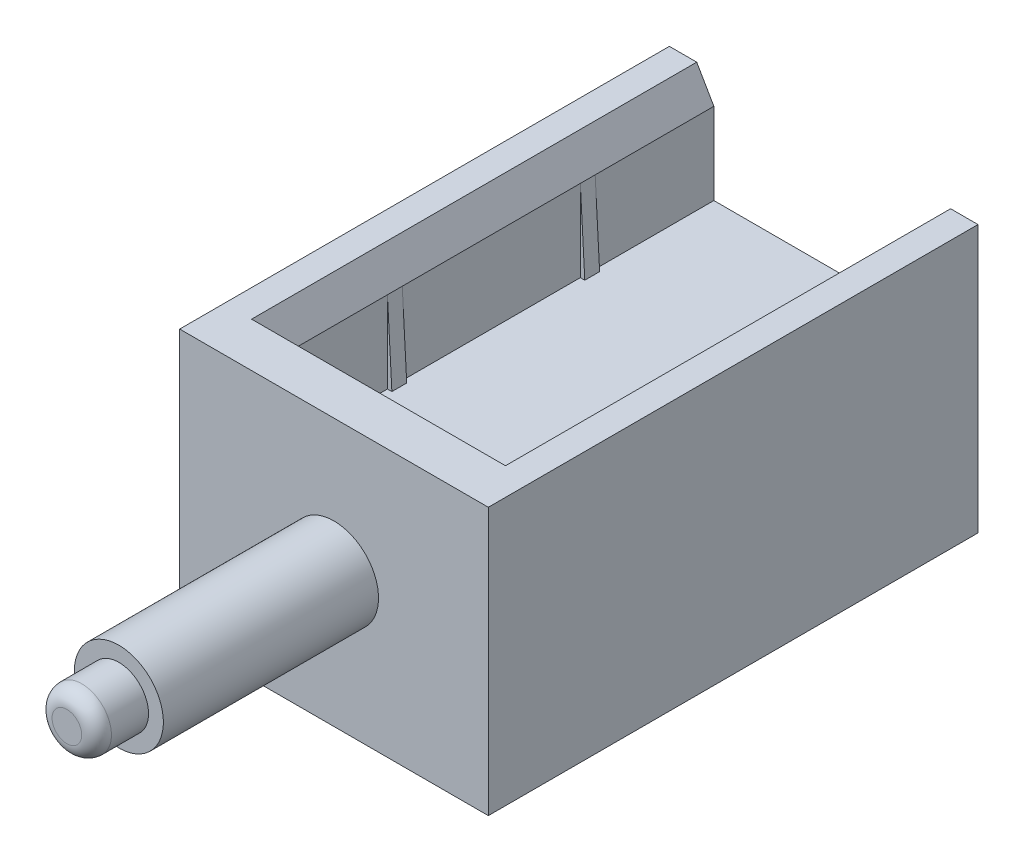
ISO-10303-21;
HEADER;
FILE_DESCRIPTION(('STEP AP214'),'2;1');
FILE_NAME('part.step','',(''),(''),'','','');
FILE_SCHEMA(('AUTOMOTIVE_DESIGN { 1 0 10303 214 1 1 1 1 }'));
ENDSEC;
DATA;
#1=APPLICATION_CONTEXT('core data for automotive mechanical design processes');
#2=APPLICATION_PROTOCOL_DEFINITION('international standard','automotive_design',2000,#1);
#3=PRODUCT_CONTEXT('',#1,'mechanical');
#4=PRODUCT('Part','Part','',(#3));
#5=PRODUCT_RELATED_PRODUCT_CATEGORY('part','',(#4));
#6=PRODUCT_DEFINITION_FORMATION('','',#4);
#7=PRODUCT_DEFINITION_CONTEXT('part definition',#1,'design');
#8=PRODUCT_DEFINITION('design','',#6,#7);
#9=PRODUCT_DEFINITION_SHAPE('','',#8);
#10=(LENGTH_UNIT() NAMED_UNIT(*) SI_UNIT(.MILLI.,.METRE.));
#11=(NAMED_UNIT(*) PLANE_ANGLE_UNIT() SI_UNIT($,.RADIAN.));
#12=(NAMED_UNIT(*) SI_UNIT($,.STERADIAN.) SOLID_ANGLE_UNIT());
#13=UNCERTAINTY_MEASURE_WITH_UNIT(LENGTH_MEASURE(1.E-05),#10,'distance_accuracy_value','');
#14=(GEOMETRIC_REPRESENTATION_CONTEXT(3) GLOBAL_UNCERTAINTY_ASSIGNED_CONTEXT((#13)) GLOBAL_UNIT_ASSIGNED_CONTEXT((#10,
#11,#12)) REPRESENTATION_CONTEXT('',''));
#15=CARTESIAN_POINT('',(0.,0.,0.));
#16=DIRECTION('',(0.,0.,1.));
#17=DIRECTION('',(1.,0.,0.));
#18=AXIS2_PLACEMENT_3D('',#15,#16,#17);
#19=CARTESIAN_POINT('',(-7.4,-1.5,0.));
#20=DIRECTION('',(0.,-1.,0.));
#21=DIRECTION('',(0.,0.,-1.));
#22=AXIS2_PLACEMENT_3D('',#19,#20,#21);
#23=PLANE('',#22);
#24=DIRECTION('',(0.,0.,-1.));
#25=VECTOR('',#24,1.);
#26=CARTESIAN_POINT('',(7.1,-1.5,-8.));
#27=LINE('',#26,#25);
#28=CARTESIAN_POINT('',(7.1,-1.5,-8.));
#29=VERTEX_POINT('',#28);
#30=CARTESIAN_POINT('',(7.1,-1.5,-9.));
#31=VERTEX_POINT('',#30);
#32=EDGE_CURVE('E56',#29,#31,#27,.T.);
#33=ORIENTED_EDGE('',*,*,#32,.F.);
#34=DIRECTION('',(-1.,0.,0.));
#35=VECTOR('',#34,1.);
#36=CARTESIAN_POINT('',(7.1,-1.5,-8.));
#37=LINE('',#36,#35);
#38=CARTESIAN_POINT('',(7.4,-1.5,-8.));
#39=VERTEX_POINT('',#38);
#40=EDGE_CURVE('E340',#39,#29,#37,.T.);
#41=ORIENTED_EDGE('',*,*,#40,.F.);
#42=DIRECTION('',(0.,0.,-1.));
#43=VECTOR('',#42,1.);
#44=CARTESIAN_POINT('',(7.4,-1.5,0.));
#45=LINE('',#44,#43);
#46=CARTESIAN_POINT('',(7.4,-1.5,0.));
#47=VERTEX_POINT('',#46);
#48=EDGE_CURVE('E546',#47,#39,#45,.T.);
#49=ORIENTED_EDGE('',*,*,#48,.F.);
#50=DIRECTION('',(1.,0.,0.));
#51=VECTOR('',#50,1.);
#52=CARTESIAN_POINT('',(-7.4,-1.5,0.));
#53=LINE('',#52,#51);
#54=CARTESIAN_POINT('',(-7.4,-1.5,0.));
#55=VERTEX_POINT('',#54);
#56=EDGE_CURVE('E565',#55,#47,#53,.T.);
#57=ORIENTED_EDGE('',*,*,#56,.F.);
#58=DIRECTION('',(0.,0.,-1.));
#59=VECTOR('',#58,1.);
#60=CARTESIAN_POINT('',(-7.4,-1.5,0.));
#61=LINE('',#60,#59);
#62=CARTESIAN_POINT('',(-7.4,-1.5,-8.));
#63=VERTEX_POINT('',#62);
#64=EDGE_CURVE('E556',#55,#63,#61,.T.);
#65=ORIENTED_EDGE('',*,*,#64,.T.);
#66=DIRECTION('',(-1.,0.,0.));
#67=VECTOR('',#66,1.);
#68=CARTESIAN_POINT('',(-7.4,-1.5,-8.));
#69=LINE('',#68,#67);
#70=CARTESIAN_POINT('',(-7.1,-1.5,-8.));
#71=VERTEX_POINT('',#70);
#72=EDGE_CURVE('E372',#71,#63,#69,.T.);
#73=ORIENTED_EDGE('',*,*,#72,.F.);
#74=DIRECTION('',(0.,0.,-1.));
#75=VECTOR('',#74,1.);
#76=CARTESIAN_POINT('',(-7.1,-1.5,-8.));
#77=LINE('',#76,#75);
#78=CARTESIAN_POINT('',(-7.1,-1.5,-9.));
#79=VERTEX_POINT('',#78);
#80=EDGE_CURVE('E348',#71,#79,#77,.T.);
#81=ORIENTED_EDGE('',*,*,#80,.T.);
#82=DIRECTION('',(-1.,0.,0.));
#83=VECTOR('',#82,1.);
#84=CARTESIAN_POINT('',(-7.4,-1.5,-9.));
#85=LINE('',#84,#83);
#86=CARTESIAN_POINT('',(-7.4,-1.5,-9.));
#87=VERTEX_POINT('',#86);
#88=EDGE_CURVE('E363',#79,#87,#85,.T.);
#89=ORIENTED_EDGE('',*,*,#88,.T.);
#90=CARTESIAN_POINT('',(-7.4,-1.5,-21.));
#91=VERTEX_POINT('',#90);
#92=EDGE_CURVE('E560',#87,#91,#61,.T.);
#93=ORIENTED_EDGE('',*,*,#92,.T.);
#94=DIRECTION('',(1.,0.,0.));
#95=VECTOR('',#94,1.);
#96=CARTESIAN_POINT('',(-7.4,-1.5,-21.));
#97=LINE('',#96,#95);
#98=CARTESIAN_POINT('',(-7.1,-1.5,-21.));
#99=VERTEX_POINT('',#98);
#100=EDGE_CURVE('E452',#91,#99,#97,.T.);
#101=ORIENTED_EDGE('',*,*,#100,.T.);
#102=DIRECTION('',(0.,0.,-1.));
#103=VECTOR('',#102,1.);
#104=CARTESIAN_POINT('',(-7.1,-1.5,-21.));
#105=LINE('',#104,#103);
#106=CARTESIAN_POINT('',(-7.1,-1.5,-22.));
#107=VERTEX_POINT('',#106);
#108=EDGE_CURVE('E443',#99,#107,#105,.T.);
#109=ORIENTED_EDGE('',*,*,#108,.T.);
#110=DIRECTION('',(1.,0.,0.));
#111=VECTOR('',#110,1.);
#112=CARTESIAN_POINT('',(-7.4,-1.5,-22.));
#113=LINE('',#112,#111);
#114=CARTESIAN_POINT('',(-7.4,-1.5,-22.));
#115=VERTEX_POINT('',#114);
#116=EDGE_CURVE('E455',#115,#107,#113,.T.);
#117=ORIENTED_EDGE('',*,*,#116,.F.);
#118=CARTESIAN_POINT('',(-7.4,-1.5,-30.));
#119=VERTEX_POINT('',#118);
#120=EDGE_CURVE('E554',#115,#119,#61,.T.);
#121=ORIENTED_EDGE('',*,*,#120,.T.);
#122=DIRECTION('',(1.,0.,0.));
#123=VECTOR('',#122,1.);
#124=CARTESIAN_POINT('',(-7.4,-1.5,-30.));
#125=LINE('',#124,#123);
#126=CARTESIAN_POINT('',(7.4,-1.5,-30.));
#127=VERTEX_POINT('',#126);
#128=EDGE_CURVE('E561',#119,#127,#125,.T.);
#129=ORIENTED_EDGE('',*,*,#128,.T.);
#130=CARTESIAN_POINT('',(7.4,-1.5,-22.));
#131=VERTEX_POINT('',#130);
#132=EDGE_CURVE('E544',#131,#127,#45,.T.);
#133=ORIENTED_EDGE('',*,*,#132,.F.);
#134=DIRECTION('',(1.,0.,0.));
#135=VECTOR('',#134,1.);
#136=CARTESIAN_POINT('',(7.4,-1.5,-22.));
#137=LINE('',#136,#135);
#138=CARTESIAN_POINT('',(7.1,-1.5,-22.));
#139=VERTEX_POINT('',#138);
#140=EDGE_CURVE('E425',#139,#131,#137,.T.);
#141=ORIENTED_EDGE('',*,*,#140,.F.);
#142=DIRECTION('',(0.,0.,-1.));
#143=VECTOR('',#142,1.);
#144=CARTESIAN_POINT('',(7.1,-1.5,-21.));
#145=LINE('',#144,#143);
#146=CARTESIAN_POINT('',(7.1,-1.5,-21.));
#147=VERTEX_POINT('',#146);
#148=EDGE_CURVE('E419',#147,#139,#145,.T.);
#149=ORIENTED_EDGE('',*,*,#148,.F.);
#150=DIRECTION('',(1.,0.,0.));
#151=VECTOR('',#150,1.);
#152=CARTESIAN_POINT('',(7.4,-1.5,-21.));
#153=LINE('',#152,#151);
#154=CARTESIAN_POINT('',(7.4,-1.5,-21.));
#155=VERTEX_POINT('',#154);
#156=EDGE_CURVE('E422',#147,#155,#153,.T.);
#157=ORIENTED_EDGE('',*,*,#156,.T.);
#158=CARTESIAN_POINT('',(7.4,-1.5,-9.));
#159=VERTEX_POINT('',#158);
#160=EDGE_CURVE('E550',#159,#155,#45,.T.);
#161=ORIENTED_EDGE('',*,*,#160,.F.);
#162=DIRECTION('',(-1.,0.,0.));
#163=VECTOR('',#162,1.);
#164=CARTESIAN_POINT('',(7.1,-1.5,-9.));
#165=LINE('',#164,#163);
#166=EDGE_CURVE('E61',#159,#31,#165,.T.);
#167=ORIENTED_EDGE('',*,*,#166,.T.);
#168=EDGE_LOOP('',(#33,#41,#49,#57,#65,#73,#81,#89,#93,#101,#109,#117,#121,#129,#133,#141,#149,
#157,#161,#167));
#169=FACE_BOUND('',#168,.T.);
#170=ADVANCED_FACE('F41',(#169),#23,.T.);
#171=CARTESIAN_POINT('',(7.4,0.,0.));
#172=DIRECTION('',(1.,0.,0.));
#173=DIRECTION('',(0.,0.,-1.));
#174=AXIS2_PLACEMENT_3D('',#171,#172,#173);
#175=PLANE('',#174);
#176=DIRECTION('',(0.,1.,0.));
#177=VECTOR('',#176,1.);
#178=CARTESIAN_POINT('',(7.4,-1.5,-8.));
#179=LINE('',#178,#177);
#180=CARTESIAN_POINT('',(7.4,-6.99999999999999,-8.));
#181=VERTEX_POINT('',#180);
#182=EDGE_CURVE('E350',#181,#39,#179,.T.);
#183=ORIENTED_EDGE('',*,*,#182,.F.);
#184=DIRECTION('',(0.,0.,1.));
#185=VECTOR('',#184,1.);
#186=CARTESIAN_POINT('',(7.4,-6.99999999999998,0.));
#187=LINE('',#186,#185);
#188=CARTESIAN_POINT('',(7.4,-6.99999999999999,0.));
#189=VERTEX_POINT('',#188);
#190=EDGE_CURVE('E582',#181,#189,#187,.T.);
#191=ORIENTED_EDGE('',*,*,#190,.T.);
#192=DIRECTION('',(0.,-1.,0.));
#193=VECTOR('',#192,1.);
#194=CARTESIAN_POINT('',(7.4,9.,0.));
#195=LINE('',#194,#193);
#196=EDGE_CURVE('E506',#47,#189,#195,.T.);
#197=ORIENTED_EDGE('',*,*,#196,.F.);
#198=ORIENTED_EDGE('',*,*,#48,.T.);
#199=EDGE_LOOP('',(#183,#191,#197,#198));
#200=FACE_BOUND('',#199,.T.);
#201=ADVANCED_FACE('F640',(#200),#175,.F.);
#202=CARTESIAN_POINT('',(-7.4,0.,0.));
#203=DIRECTION('',(-1.,0.,0.));
#204=DIRECTION('',(0.,0.,1.));
#205=AXIS2_PLACEMENT_3D('',#202,#203,#204);
#206=PLANE('',#205);
#207=DIRECTION('',(0.,-1.,0.));
#208=VECTOR('',#207,1.);
#209=CARTESIAN_POINT('',(-7.4,-6.99999999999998,-9.));
#210=LINE('',#209,#208);
#211=CARTESIAN_POINT('',(-7.4,-6.99999999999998,-9.));
#212=VERTEX_POINT('',#211);
#213=EDGE_CURVE('E360',#87,#212,#210,.T.);
#214=ORIENTED_EDGE('',*,*,#213,.T.);
#215=DIRECTION('',(0.,0.,-1.));
#216=VECTOR('',#215,1.);
#217=CARTESIAN_POINT('',(-7.4,-6.99999999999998,0.));
#218=LINE('',#217,#216);
#219=CARTESIAN_POINT('',(-7.4,-6.99999999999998,-21.));
#220=VERTEX_POINT('',#219);
#221=EDGE_CURVE('E615',#212,#220,#218,.T.);
#222=ORIENTED_EDGE('',*,*,#221,.T.);
#223=DIRECTION('',(0.,1.,0.));
#224=VECTOR('',#223,1.);
#225=CARTESIAN_POINT('',(-7.4,-6.99999999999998,-21.));
#226=LINE('',#225,#224);
#227=EDGE_CURVE('E445',#220,#91,#226,.T.);
#228=ORIENTED_EDGE('',*,*,#227,.T.);
#229=ORIENTED_EDGE('',*,*,#92,.F.);
#230=EDGE_LOOP('',(#214,#222,#228,#229));
#231=FACE_BOUND('',#230,.T.);
#232=ADVANCED_FACE('F646',(#231),#206,.F.);
#233=CARTESIAN_POINT('',(-7.4,1.5,0.));
#234=DIRECTION('',(0.,1.,0.));
#235=DIRECTION('',(0.,0.,1.));
#236=AXIS2_PLACEMENT_3D('',#233,#234,#235);
#237=PLANE('',#236);
#238=DIRECTION('',(0.,0.,1.));
#239=VECTOR('',#238,1.);
#240=CARTESIAN_POINT('',(7.4,1.5,0.));
#241=LINE('',#240,#239);
#242=CARTESIAN_POINT('',(7.4,1.5,-8.));
#243=VERTEX_POINT('',#242);
#244=CARTESIAN_POINT('',(7.4,1.5,0.));
#245=VERTEX_POINT('',#244);
#246=EDGE_CURVE('E540',#243,#245,#241,.T.);
#247=ORIENTED_EDGE('',*,*,#246,.F.);
#248=DIRECTION('',(1.,0.,0.));
#249=VECTOR('',#248,1.);
#250=CARTESIAN_POINT('',(7.1,1.5,-8.));
#251=LINE('',#250,#249);
#252=CARTESIAN_POINT('',(7.1,1.5,-8.));
#253=VERTEX_POINT('',#252);
#254=EDGE_CURVE('E381',#253,#243,#251,.T.);
#255=ORIENTED_EDGE('',*,*,#254,.F.);
#256=DIRECTION('',(0.,0.,-1.));
#257=VECTOR('',#256,1.);
#258=CARTESIAN_POINT('',(7.1,1.5,-8.));
#259=LINE('',#258,#257);
#260=CARTESIAN_POINT('',(7.1,1.5,-9.));
#261=VERTEX_POINT('',#260);
#262=EDGE_CURVE('E379',#253,#261,#259,.T.);
#263=ORIENTED_EDGE('',*,*,#262,.T.);
#264=DIRECTION('',(1.,0.,0.));
#265=VECTOR('',#264,1.);
#266=CARTESIAN_POINT('',(7.1,1.5,-9.));
#267=LINE('',#266,#265);
#268=CARTESIAN_POINT('',(7.4,1.5,-9.));
#269=VERTEX_POINT('',#268);
#270=EDGE_CURVE('E382',#261,#269,#267,.T.);
#271=ORIENTED_EDGE('',*,*,#270,.T.);
#272=CARTESIAN_POINT('',(7.4,1.5,-21.));
#273=VERTEX_POINT('',#272);
#274=EDGE_CURVE('E545',#273,#269,#241,.T.);
#275=ORIENTED_EDGE('',*,*,#274,.F.);
#276=DIRECTION('',(-1.,0.,0.));
#277=VECTOR('',#276,1.);
#278=CARTESIAN_POINT('',(7.4,1.5,-21.));
#279=LINE('',#278,#277);
#280=CARTESIAN_POINT('',(7.1,1.5,-21.));
#281=VERTEX_POINT('',#280);
#282=EDGE_CURVE('E474',#273,#281,#279,.T.);
#283=ORIENTED_EDGE('',*,*,#282,.T.);
#284=DIRECTION('',(0.,0.,-1.));
#285=VECTOR('',#284,1.);
#286=CARTESIAN_POINT('',(7.1,1.5,-21.));
#287=LINE('',#286,#285);
#288=CARTESIAN_POINT('',(7.1,1.5,-22.));
#289=VERTEX_POINT('',#288);
#290=EDGE_CURVE('E465',#281,#289,#287,.T.);
#291=ORIENTED_EDGE('',*,*,#290,.T.);
#292=DIRECTION('',(-1.,0.,0.));
#293=VECTOR('',#292,1.);
#294=CARTESIAN_POINT('',(7.4,1.5,-22.));
#295=LINE('',#294,#293);
#296=CARTESIAN_POINT('',(7.4,1.5,-22.));
#297=VERTEX_POINT('',#296);
#298=EDGE_CURVE('E477',#297,#289,#295,.T.);
#299=ORIENTED_EDGE('',*,*,#298,.F.);
#300=CARTESIAN_POINT('',(7.4,1.5,-30.));
#301=VERTEX_POINT('',#300);
#302=EDGE_CURVE('E541',#301,#297,#241,.T.);
#303=ORIENTED_EDGE('',*,*,#302,.F.);
#304=DIRECTION('',(1.,0.,0.));
#305=VECTOR('',#304,1.);
#306=CARTESIAN_POINT('',(-7.4,1.5,-30.));
#307=LINE('',#306,#305);
#308=CARTESIAN_POINT('',(-7.4,1.5,-30.));
#309=VERTEX_POINT('',#308);
#310=EDGE_CURVE('E559',#309,#301,#307,.T.);
#311=ORIENTED_EDGE('',*,*,#310,.F.);
#312=DIRECTION('',(0.,0.,1.));
#313=VECTOR('',#312,1.);
#314=CARTESIAN_POINT('',(-7.4,1.5,0.));
#315=LINE('',#314,#313);
#316=CARTESIAN_POINT('',(-7.4,1.5,-22.));
#317=VERTEX_POINT('',#316);
#318=EDGE_CURVE('E551',#309,#317,#315,.T.);
#319=ORIENTED_EDGE('',*,*,#318,.T.);
#320=DIRECTION('',(-1.,0.,0.));
#321=VECTOR('',#320,1.);
#322=CARTESIAN_POINT('',(-7.4,1.5,-22.));
#323=LINE('',#322,#321);
#324=CARTESIAN_POINT('',(-7.1,1.5,-22.));
#325=VERTEX_POINT('',#324);
#326=EDGE_CURVE('E490',#325,#317,#323,.T.);
#327=ORIENTED_EDGE('',*,*,#326,.F.);
#328=DIRECTION('',(0.,0.,-1.));
#329=VECTOR('',#328,1.);
#330=CARTESIAN_POINT('',(-7.1,1.5,-21.));
#331=LINE('',#330,#329);
#332=CARTESIAN_POINT('',(-7.1,1.5,-21.));
#333=VERTEX_POINT('',#332);
#334=EDGE_CURVE('E503',#333,#325,#331,.T.);
#335=ORIENTED_EDGE('',*,*,#334,.F.);
#336=DIRECTION('',(-1.,0.,0.));
#337=VECTOR('',#336,1.);
#338=CARTESIAN_POINT('',(-7.4,1.5,-21.));
#339=LINE('',#338,#337);
#340=CARTESIAN_POINT('',(-7.4,1.5,-21.));
#341=VERTEX_POINT('',#340);
#342=EDGE_CURVE('E493',#333,#341,#339,.T.);
#343=ORIENTED_EDGE('',*,*,#342,.T.);
#344=CARTESIAN_POINT('',(-7.4,1.5,-9.));
#345=VERTEX_POINT('',#344);
#346=EDGE_CURVE('E555',#341,#345,#315,.T.);
#347=ORIENTED_EDGE('',*,*,#346,.T.);
#348=DIRECTION('',(1.,0.,0.));
#349=VECTOR('',#348,1.);
#350=CARTESIAN_POINT('',(-7.4,1.5,-9.));
#351=LINE('',#350,#349);
#352=CARTESIAN_POINT('',(-7.1,1.5,-9.));
#353=VERTEX_POINT('',#352);
#354=EDGE_CURVE('E391',#345,#353,#351,.T.);
#355=ORIENTED_EDGE('',*,*,#354,.T.);
#356=DIRECTION('',(0.,0.,-1.));
#357=VECTOR('',#356,1.);
#358=CARTESIAN_POINT('',(-7.1,1.5,-8.));
#359=LINE('',#358,#357);
#360=CARTESIAN_POINT('',(-7.1,1.5,-8.));
#361=VERTEX_POINT('',#360);
#362=EDGE_CURVE('E416',#361,#353,#359,.T.);
#363=ORIENTED_EDGE('',*,*,#362,.F.);
#364=DIRECTION('',(1.,0.,0.));
#365=VECTOR('',#364,1.);
#366=CARTESIAN_POINT('',(-7.4,1.5,-8.));
#367=LINE('',#366,#365);
#368=CARTESIAN_POINT('',(-7.4,1.5,-8.));
#369=VERTEX_POINT('',#368);
#370=EDGE_CURVE('E399',#369,#361,#367,.T.);
#371=ORIENTED_EDGE('',*,*,#370,.F.);
#372=CARTESIAN_POINT('',(-7.4,1.5,0.));
#373=VERTEX_POINT('',#372);
#374=EDGE_CURVE('E549',#369,#373,#315,.T.);
#375=ORIENTED_EDGE('',*,*,#374,.T.);
#376=DIRECTION('',(1.,0.,0.));
#377=VECTOR('',#376,1.);
#378=CARTESIAN_POINT('',(-7.4,1.5,0.));
#379=LINE('',#378,#377);
#380=EDGE_CURVE('E568',#373,#245,#379,.T.);
#381=ORIENTED_EDGE('',*,*,#380,.T.);
#382=EDGE_LOOP('',(#247,#255,#263,#271,#275,#283,#291,#299,#303,#311,#319,#327,#335,#343,#347,
#355,#363,#371,#375,#381));
#383=FACE_BOUND('',#382,.T.);
#384=ADVANCED_FACE('F654',(#383),#237,.T.);
#385=DIRECTION('',(0.,1.,0.));
#386=VECTOR('',#385,1.);
#387=CARTESIAN_POINT('',(7.4,1.5,-8.));
#388=LINE('',#387,#386);
#389=CARTESIAN_POINT('',(7.4,6.99999999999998,-8.));
#390=VERTEX_POINT('',#389);
#391=EDGE_CURVE('E385',#243,#390,#388,.T.);
#392=ORIENTED_EDGE('',*,*,#391,.F.);
#393=ORIENTED_EDGE('',*,*,#246,.T.);
#394=CARTESIAN_POINT('',(7.4,6.99999999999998,0.));
#395=VERTEX_POINT('',#394);
#396=EDGE_CURVE('E515',#395,#245,#195,.T.);
#397=ORIENTED_EDGE('',*,*,#396,.F.);
#398=DIRECTION('',(0.,0.,-1.));
#399=VECTOR('',#398,1.);
#400=CARTESIAN_POINT('',(7.4,6.99999999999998,0.));
#401=LINE('',#400,#399);
#402=EDGE_CURVE('E603',#395,#390,#401,.T.);
#403=ORIENTED_EDGE('',*,*,#402,.T.);
#404=EDGE_LOOP('',(#392,#393,#397,#403));
#405=FACE_BOUND('',#404,.T.);
#406=ADVANCED_FACE('F649',(#405),#175,.F.);
#407=DIRECTION('',(0.,-1.,0.));
#408=VECTOR('',#407,1.);
#409=CARTESIAN_POINT('',(-7.4,6.99999999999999,-8.));
#410=LINE('',#409,#408);
#411=CARTESIAN_POINT('',(-7.4,6.99999999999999,-8.));
#412=VERTEX_POINT('',#411);
#413=EDGE_CURVE('E406',#412,#369,#410,.T.);
#414=ORIENTED_EDGE('',*,*,#413,.F.);
#415=DIRECTION('',(0.,0.,1.));
#416=VECTOR('',#415,1.);
#417=CARTESIAN_POINT('',(-7.4,6.99999999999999,0.));
#418=LINE('',#417,#416);
#419=CARTESIAN_POINT('',(-7.4,6.99999999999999,0.));
#420=VERTEX_POINT('',#419);
#421=EDGE_CURVE('E618',#412,#420,#418,.T.);
#422=ORIENTED_EDGE('',*,*,#421,.T.);
#423=DIRECTION('',(0.,1.,0.));
#424=VECTOR('',#423,1.);
#425=CARTESIAN_POINT('',(-7.4,-9.,0.));
#426=LINE('',#425,#424);
#427=EDGE_CURVE('E533',#373,#420,#426,.T.);
#428=ORIENTED_EDGE('',*,*,#427,.F.);
#429=ORIENTED_EDGE('',*,*,#374,.F.);
#430=EDGE_LOOP('',(#414,#422,#428,#429));
#431=FACE_BOUND('',#430,.T.);
#432=ADVANCED_FACE('F709',(#431),#206,.F.);
#433=DIRECTION('',(0.,-1.,0.));
#434=VECTOR('',#433,1.);
#435=CARTESIAN_POINT('',(7.4,-6.99999999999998,-22.));
#436=LINE('',#435,#434);
#437=CARTESIAN_POINT('',(7.4,-6.99999999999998,-22.));
#438=VERTEX_POINT('',#437);
#439=EDGE_CURVE('E432',#131,#438,#436,.T.);
#440=ORIENTED_EDGE('',*,*,#439,.F.);
#441=ORIENTED_EDGE('',*,*,#132,.T.);
#442=DIRECTION('',(0.,1.,0.));
#443=VECTOR('',#442,1.);
#444=CARTESIAN_POINT('',(7.4,9.,-30.));
#445=LINE('',#444,#443);
#446=CARTESIAN_POINT('',(7.4,-6.99999999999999,-30.));
#447=VERTEX_POINT('',#446);
#448=EDGE_CURVE('E510',#447,#127,#445,.T.);
#449=ORIENTED_EDGE('',*,*,#448,.F.);
#450=EDGE_CURVE('E583',#447,#438,#187,.T.);
#451=ORIENTED_EDGE('',*,*,#450,.T.);
#452=EDGE_LOOP('',(#440,#441,#449,#451));
#453=FACE_BOUND('',#452,.T.);
#454=ADVANCED_FACE('F853',(#453),#175,.F.);
#455=DIRECTION('',(0.,1.,0.));
#456=VECTOR('',#455,1.);
#457=CARTESIAN_POINT('',(-7.4,-6.99999999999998,-22.));
#458=LINE('',#457,#456);
#459=CARTESIAN_POINT('',(-7.4,-6.99999999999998,-22.));
#460=VERTEX_POINT('',#459);
#461=EDGE_CURVE('E448',#460,#115,#458,.T.);
#462=ORIENTED_EDGE('',*,*,#461,.F.);
#463=CARTESIAN_POINT('',(-7.4,-6.99999999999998,-30.));
#464=VERTEX_POINT('',#463);
#465=EDGE_CURVE('E610',#460,#464,#218,.T.);
#466=ORIENTED_EDGE('',*,*,#465,.T.);
#467=DIRECTION('',(0.,-1.,0.));
#468=VECTOR('',#467,1.);
#469=CARTESIAN_POINT('',(-7.4,-9.,-30.));
#470=LINE('',#469,#468);
#471=EDGE_CURVE('E526',#119,#464,#470,.T.);
#472=ORIENTED_EDGE('',*,*,#471,.F.);
#473=ORIENTED_EDGE('',*,*,#120,.F.);
#474=EDGE_LOOP('',(#462,#466,#472,#473));
#475=FACE_BOUND('',#474,.T.);
#476=ADVANCED_FACE('F849',(#475),#206,.F.);
#477=DIRECTION('',(0.,-1.,0.));
#478=VECTOR('',#477,1.);
#479=CARTESIAN_POINT('',(7.4,6.99999999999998,-22.));
#480=LINE('',#479,#478);
#481=CARTESIAN_POINT('',(7.4,6.99999999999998,-22.));
#482=VERTEX_POINT('',#481);
#483=EDGE_CURVE('E470',#482,#297,#480,.T.);
#484=ORIENTED_EDGE('',*,*,#483,.F.);
#485=CARTESIAN_POINT('',(7.4,6.99999999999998,-30.));
#486=VERTEX_POINT('',#485);
#487=EDGE_CURVE('E602',#482,#486,#401,.T.);
#488=ORIENTED_EDGE('',*,*,#487,.T.);
#489=EDGE_CURVE('E518',#301,#486,#445,.T.);
#490=ORIENTED_EDGE('',*,*,#489,.F.);
#491=ORIENTED_EDGE('',*,*,#302,.T.);
#492=EDGE_LOOP('',(#484,#488,#490,#491));
#493=FACE_BOUND('',#492,.T.);
#494=ADVANCED_FACE('F836',(#493),#175,.F.);
#495=DIRECTION('',(0.,1.,0.));
#496=VECTOR('',#495,1.);
#497=CARTESIAN_POINT('',(-7.4,6.99999999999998,-22.));
#498=LINE('',#497,#496);
#499=CARTESIAN_POINT('',(-7.4,6.99999999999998,-22.));
#500=VERTEX_POINT('',#499);
#501=EDGE_CURVE('E480',#317,#500,#498,.T.);
#502=ORIENTED_EDGE('',*,*,#501,.F.);
#503=ORIENTED_EDGE('',*,*,#318,.F.);
#504=CARTESIAN_POINT('',(-7.4,6.99999999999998,-30.));
#505=VERTEX_POINT('',#504);
#506=EDGE_CURVE('E531',#505,#309,#470,.T.);
#507=ORIENTED_EDGE('',*,*,#506,.F.);
#508=EDGE_CURVE('E619',#505,#500,#418,.T.);
#509=ORIENTED_EDGE('',*,*,#508,.T.);
#510=EDGE_LOOP('',(#502,#503,#507,#509));
#511=FACE_BOUND('',#510,.T.);
#512=ADVANCED_FACE('F662',(#511),#206,.F.);
#513=CARTESIAN_POINT('',(-7.4,-1.5,-30.));
#514=DIRECTION('',(0.,0.,-1.));
#515=DIRECTION('',(-1.,0.,0.));
#516=AXIS2_PLACEMENT_3D('',#513,#514,#515);
#517=PLANE('',#516);
#518=DIRECTION('',(-1.,0.,0.));
#519=VECTOR('',#518,1.);
#520=CARTESIAN_POINT('',(10.4,-9.,-30.));
#521=LINE('',#520,#519);
#522=CARTESIAN_POINT('',(10.4,-9.,-30.));
#523=VERTEX_POINT('',#522);
#524=CARTESIAN_POINT('',(8.55470053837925,-9.,-30.));
#525=VERTEX_POINT('',#524);
#526=EDGE_CURVE('E523',#523,#525,#521,.T.);
#527=ORIENTED_EDGE('',*,*,#526,.T.);
#528=DIRECTION('',(0.499999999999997,-0.86602540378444,0.));
#529=VECTOR('',#528,1.);
#530=CARTESIAN_POINT('',(1.31843013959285,3.53358798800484,-30.));
#531=LINE('',#530,#529);
#532=EDGE_CURVE('E580',#525,#447,#531,.F.);
#533=ORIENTED_EDGE('',*,*,#532,.T.);
#534=ORIENTED_EDGE('',*,*,#448,.T.);
#535=ORIENTED_EDGE('',*,*,#128,.F.);
#536=ORIENTED_EDGE('',*,*,#471,.T.);
#537=DIRECTION('',(0.499999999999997,0.86602540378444,0.));
#538=VECTOR('',#537,1.);
#539=CARTESIAN_POINT('',(-5.01843013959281,-2.87499999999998,-30.));
#540=LINE('',#539,#538);
#541=CARTESIAN_POINT('',(-8.55470053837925,-9.,-30.));
#542=VERTEX_POINT('',#541);
#543=EDGE_CURVE('E576',#464,#542,#540,.F.);
#544=ORIENTED_EDGE('',*,*,#543,.T.);
#545=DIRECTION('',(1.,0.,0.));
#546=VECTOR('',#545,1.);
#547=CARTESIAN_POINT('',(-10.4,-9.,-30.));
#548=LINE('',#547,#546);
#549=CARTESIAN_POINT('',(-10.4,-9.,-30.));
#550=VERTEX_POINT('',#549);
#551=EDGE_CURVE('E538',#550,#542,#548,.T.);
#552=ORIENTED_EDGE('',*,*,#551,.F.);
#553=DIRECTION('',(0.,-1.,0.));
#554=VECTOR('',#553,1.);
#555=CARTESIAN_POINT('',(-10.4,-9.,-30.));
#556=LINE('',#555,#554);
#557=CARTESIAN_POINT('',(-10.4,9.,-30.));
#558=VERTEX_POINT('',#557);
#559=EDGE_CURVE('E303',#558,#550,#556,.T.);
#560=ORIENTED_EDGE('',*,*,#559,.F.);
#561=DIRECTION('',(1.,0.,0.));
#562=VECTOR('',#561,1.);
#563=CARTESIAN_POINT('',(-10.4,9.,-30.));
#564=LINE('',#563,#562);
#565=CARTESIAN_POINT('',(-8.55470053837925,9.,-30.));
#566=VERTEX_POINT('',#565);
#567=EDGE_CURVE('E530',#558,#566,#564,.T.);
#568=ORIENTED_EDGE('',*,*,#567,.T.);
#569=DIRECTION('',(-0.499999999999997,0.86602540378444,0.));
#570=VECTOR('',#569,1.);
#571=CARTESIAN_POINT('',(-3.71939203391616,0.624999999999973,-30.));
#572=LINE('',#571,#570);
#573=EDGE_CURVE('E574',#566,#505,#572,.F.);
#574=ORIENTED_EDGE('',*,*,#573,.T.);
#575=ORIENTED_EDGE('',*,*,#506,.T.);
#576=ORIENTED_EDGE('',*,*,#310,.T.);
#577=ORIENTED_EDGE('',*,*,#489,.T.);
#578=DIRECTION('',(-0.499999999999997,-0.86602540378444,0.));
#579=VECTOR('',#578,1.);
#580=CARTESIAN_POINT('',(0.0193920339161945,-5.78358798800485,-30.));
#581=LINE('',#580,#579);
#582=CARTESIAN_POINT('',(8.55470053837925,9.,-30.));
#583=VERTEX_POINT('',#582);
#584=EDGE_CURVE('E578',#486,#583,#581,.F.);
#585=ORIENTED_EDGE('',*,*,#584,.T.);
#586=DIRECTION('',(-1.,0.,0.));
#587=VECTOR('',#586,1.);
#588=CARTESIAN_POINT('',(10.4,9.,-30.));
#589=LINE('',#588,#587);
#590=CARTESIAN_POINT('',(10.4,9.,-30.));
#591=VERTEX_POINT('',#590);
#592=EDGE_CURVE('E514',#591,#583,#589,.T.);
#593=ORIENTED_EDGE('',*,*,#592,.F.);
#594=DIRECTION('',(0.,1.,0.));
#595=VECTOR('',#594,1.);
#596=CARTESIAN_POINT('',(10.4,9.,-30.));
#597=LINE('',#596,#595);
#598=EDGE_CURVE('E509',#523,#591,#597,.T.);
#599=ORIENTED_EDGE('',*,*,#598,.F.);
#600=EDGE_LOOP('',(#527,#533,#534,#535,#536,#544,#552,#560,#568,#574,#575,#576,#577,#585,#593,#599));
#601=FACE_BOUND('',#600,.T.);
#602=ADVANCED_FACE('F658',(#601),#517,.T.);
#603=CARTESIAN_POINT('',(-7.4,-6.99999999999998,0.));
#604=VERTEX_POINT('',#603);
#605=CARTESIAN_POINT('',(-7.4,-6.99999999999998,-8.));
#606=VERTEX_POINT('',#605);
#607=EDGE_CURVE('E611',#604,#606,#218,.T.);
#608=ORIENTED_EDGE('',*,*,#607,.T.);
#609=DIRECTION('',(0.,-1.,0.));
#610=VECTOR('',#609,1.);
#611=CARTESIAN_POINT('',(-7.4,-6.99999999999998,-8.));
#612=LINE('',#611,#610);
#613=EDGE_CURVE('E359',#63,#606,#612,.T.);
#614=ORIENTED_EDGE('',*,*,#613,.F.);
#615=ORIENTED_EDGE('',*,*,#64,.F.);
#616=EDGE_CURVE('E527',#604,#55,#426,.T.);
#617=ORIENTED_EDGE('',*,*,#616,.F.);
#618=EDGE_LOOP('',(#608,#614,#615,#617));
#619=FACE_BOUND('',#618,.T.);
#620=ADVANCED_FACE('F661',(#619),#206,.F.);
#621=CARTESIAN_POINT('',(-10.4,-9.,0.));
#622=DIRECTION('',(0.,1.,0.));
#623=DIRECTION('',(0.,0.,1.));
#624=AXIS2_PLACEMENT_3D('',#621,#622,#623);
#625=PLANE('',#624);
#626=ORIENTED_EDGE('',*,*,#551,.T.);
#627=DIRECTION('',(0.,0.,1.));
#628=VECTOR('',#627,1.);
#629=CARTESIAN_POINT('',(-8.55470053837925,-9.,0.));
#630=LINE('',#629,#628);
#631=CARTESIAN_POINT('',(-8.55470053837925,-9.,0.));
#632=VERTEX_POINT('',#631);
#633=EDGE_CURVE('E606',#542,#632,#630,.T.);
#634=ORIENTED_EDGE('',*,*,#633,.T.);
#635=DIRECTION('',(1.,0.,0.));
#636=VECTOR('',#635,1.);
#637=CARTESIAN_POINT('',(-10.4,-9.,0.));
#638=LINE('',#637,#636);
#639=CARTESIAN_POINT('',(8.55470053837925,-9.,0.));
#640=VERTEX_POINT('',#639);
#641=EDGE_CURVE('E326',#632,#640,#638,.T.);
#642=ORIENTED_EDGE('',*,*,#641,.T.);
#643=DIRECTION('',(0.,0.,-1.));
#644=VECTOR('',#643,1.);
#645=CARTESIAN_POINT('',(8.55470053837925,-9.,0.));
#646=LINE('',#645,#644);
#647=EDGE_CURVE('E564',#640,#525,#646,.T.);
#648=ORIENTED_EDGE('',*,*,#647,.T.);
#649=ORIENTED_EDGE('',*,*,#526,.F.);
#650=DIRECTION('',(0.,0.,-1.));
#651=VECTOR('',#650,1.);
#652=CARTESIAN_POINT('',(10.4,-9.,0.));
#653=LINE('',#652,#651);
#654=CARTESIAN_POINT('',(10.4,-9.,3.));
#655=VERTEX_POINT('',#654);
#656=EDGE_CURVE('E313',#655,#523,#653,.T.);
#657=ORIENTED_EDGE('',*,*,#656,.F.);
#658=DIRECTION('',(1.,0.,0.));
#659=VECTOR('',#658,1.);
#660=CARTESIAN_POINT('',(-10.4,-9.,3.));
#661=LINE('',#660,#659);
#662=CARTESIAN_POINT('',(-10.4,-9.,3.));
#663=VERTEX_POINT('',#662);
#664=EDGE_CURVE('E310',#663,#655,#661,.T.);
#665=ORIENTED_EDGE('',*,*,#664,.F.);
#666=DIRECTION('',(0.,0.,1.));
#667=VECTOR('',#666,1.);
#668=CARTESIAN_POINT('',(-10.4,-9.,0.));
#669=LINE('',#668,#667);
#670=EDGE_CURVE('E297',#550,#663,#669,.T.);
#671=ORIENTED_EDGE('',*,*,#670,.F.);
#672=EDGE_LOOP('',(#626,#634,#642,#648,#649,#657,#665,#671));
#673=FACE_BOUND('',#672,.T.);
#674=ADVANCED_FACE('F311',(#673),#625,.F.);
#675=CARTESIAN_POINT('',(-10.4,9.,0.));
#676=DIRECTION('',(0.,-1.,0.));
#677=DIRECTION('',(0.,0.,-1.));
#678=AXIS2_PLACEMENT_3D('',#675,#676,#677);
#679=PLANE('',#678);
#680=DIRECTION('',(0.,0.,-1.));
#681=VECTOR('',#680,1.);
#682=CARTESIAN_POINT('',(-10.4,9.,0.));
#683=LINE('',#682,#681);
#684=CARTESIAN_POINT('',(-10.4,9.,3.));
#685=VERTEX_POINT('',#684);
#686=EDGE_CURVE('E307',#685,#558,#683,.T.);
#687=ORIENTED_EDGE('',*,*,#686,.F.);
#688=DIRECTION('',(-1.,0.,0.));
#689=VECTOR('',#688,1.);
#690=CARTESIAN_POINT('',(-10.4,9.,3.));
#691=LINE('',#690,#689);
#692=CARTESIAN_POINT('',(10.4,9.,3.));
#693=VERTEX_POINT('',#692);
#694=EDGE_CURVE('E322',#693,#685,#691,.T.);
#695=ORIENTED_EDGE('',*,*,#694,.F.);
#696=DIRECTION('',(0.,0.,1.));
#697=VECTOR('',#696,1.);
#698=CARTESIAN_POINT('',(10.4,9.,0.));
#699=LINE('',#698,#697);
#700=EDGE_CURVE('E512',#591,#693,#699,.T.);
#701=ORIENTED_EDGE('',*,*,#700,.F.);
#702=ORIENTED_EDGE('',*,*,#592,.T.);
#703=DIRECTION('',(0.,0.,1.));
#704=VECTOR('',#703,1.);
#705=CARTESIAN_POINT('',(8.55470053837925,9.,0.));
#706=LINE('',#705,#704);
#707=CARTESIAN_POINT('',(8.55470053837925,9.,0.));
#708=VERTEX_POINT('',#707);
#709=EDGE_CURVE('E599',#583,#708,#706,.T.);
#710=ORIENTED_EDGE('',*,*,#709,.T.);
#711=DIRECTION('',(-1.,0.,0.));
#712=VECTOR('',#711,1.);
#713=CARTESIAN_POINT('',(-10.4,9.,0.));
#714=LINE('',#713,#712);
#715=CARTESIAN_POINT('',(-8.55470053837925,9.,0.));
#716=VERTEX_POINT('',#715);
#717=EDGE_CURVE('E323',#708,#716,#714,.T.);
#718=ORIENTED_EDGE('',*,*,#717,.T.);
#719=DIRECTION('',(0.,0.,-1.));
#720=VECTOR('',#719,1.);
#721=CARTESIAN_POINT('',(-8.55470053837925,9.,0.));
#722=LINE('',#721,#720);
#723=EDGE_CURVE('E614',#716,#566,#722,.T.);
#724=ORIENTED_EDGE('',*,*,#723,.T.);
#725=ORIENTED_EDGE('',*,*,#567,.F.);
#726=EDGE_LOOP('',(#687,#695,#701,#702,#710,#718,#724,#725));
#727=FACE_BOUND('',#726,.T.);
#728=ADVANCED_FACE('F794',(#727),#679,.F.);
#729=CARTESIAN_POINT('',(-10.4,0.,0.));
#730=DIRECTION('',(-1.,0.,0.));
#731=DIRECTION('',(0.,0.,1.));
#732=AXIS2_PLACEMENT_3D('',#729,#730,#731);
#733=PLANE('',#732);
#734=ORIENTED_EDGE('',*,*,#559,.T.);
#735=ORIENTED_EDGE('',*,*,#670,.T.);
#736=DIRECTION('',(0.,-1.,0.));
#737=VECTOR('',#736,1.);
#738=CARTESIAN_POINT('',(-10.4,9.,3.));
#739=LINE('',#738,#737);
#740=EDGE_CURVE('E301',#685,#663,#739,.T.);
#741=ORIENTED_EDGE('',*,*,#740,.F.);
#742=ORIENTED_EDGE('',*,*,#686,.T.);
#743=EDGE_LOOP('',(#734,#735,#741,#742));
#744=FACE_BOUND('',#743,.T.);
#745=ADVANCED_FACE('F299',(#744),#733,.T.);
#746=CARTESIAN_POINT('',(-7.4,6.99999999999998,-21.));
#747=VERTEX_POINT('',#746);
#748=CARTESIAN_POINT('',(-7.4,6.99999999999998,-9.));
#749=VERTEX_POINT('',#748);
#750=EDGE_CURVE('E622',#747,#749,#418,.T.);
#751=ORIENTED_EDGE('',*,*,#750,.T.);
#752=DIRECTION('',(0.,-1.,0.));
#753=VECTOR('',#752,1.);
#754=CARTESIAN_POINT('',(-7.4,6.99999999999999,-9.));
#755=LINE('',#754,#753);
#756=EDGE_CURVE('E403',#749,#345,#755,.T.);
#757=ORIENTED_EDGE('',*,*,#756,.T.);
#758=ORIENTED_EDGE('',*,*,#346,.F.);
#759=DIRECTION('',(0.,1.,0.));
#760=VECTOR('',#759,1.);
#761=CARTESIAN_POINT('',(-7.4,6.99999999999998,-21.));
#762=LINE('',#761,#760);
#763=EDGE_CURVE('E486',#341,#747,#762,.T.);
#764=ORIENTED_EDGE('',*,*,#763,.T.);
#765=EDGE_LOOP('',(#751,#757,#758,#764));
#766=FACE_BOUND('',#765,.T.);
#767=ADVANCED_FACE('F712',(#766),#206,.F.);
#768=ORIENTED_EDGE('',*,*,#274,.T.);
#769=DIRECTION('',(0.,1.,0.));
#770=VECTOR('',#769,1.);
#771=CARTESIAN_POINT('',(7.4,1.5,-9.));
#772=LINE('',#771,#770);
#773=CARTESIAN_POINT('',(7.4,6.99999999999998,-9.));
#774=VERTEX_POINT('',#773);
#775=EDGE_CURVE('E388',#269,#774,#772,.T.);
#776=ORIENTED_EDGE('',*,*,#775,.T.);
#777=CARTESIAN_POINT('',(7.4,6.99999999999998,-21.));
#778=VERTEX_POINT('',#777);
#779=EDGE_CURVE('E607',#774,#778,#401,.T.);
#780=ORIENTED_EDGE('',*,*,#779,.T.);
#781=DIRECTION('',(0.,-1.,0.));
#782=VECTOR('',#781,1.);
#783=CARTESIAN_POINT('',(7.4,6.99999999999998,-21.));
#784=LINE('',#783,#782);
#785=EDGE_CURVE('E467',#778,#273,#784,.T.);
#786=ORIENTED_EDGE('',*,*,#785,.T.);
#787=EDGE_LOOP('',(#768,#776,#780,#786));
#788=FACE_BOUND('',#787,.T.);
#789=ADVANCED_FACE('F650',(#788),#175,.F.);
#790=CARTESIAN_POINT('',(7.4,-6.99999999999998,-21.));
#791=VERTEX_POINT('',#790);
#792=CARTESIAN_POINT('',(7.4,-6.99999999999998,-9.));
#793=VERTEX_POINT('',#792);
#794=EDGE_CURVE('E587',#791,#793,#187,.T.);
#795=ORIENTED_EDGE('',*,*,#794,.T.);
#796=DIRECTION('',(0.,1.,0.));
#797=VECTOR('',#796,1.);
#798=CARTESIAN_POINT('',(7.4,-1.5,-9.));
#799=LINE('',#798,#797);
#800=EDGE_CURVE('E342',#793,#159,#799,.T.);
#801=ORIENTED_EDGE('',*,*,#800,.T.);
#802=ORIENTED_EDGE('',*,*,#160,.T.);
#803=DIRECTION('',(0.,-1.,0.));
#804=VECTOR('',#803,1.);
#805=CARTESIAN_POINT('',(7.4,-6.99999999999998,-21.));
#806=LINE('',#805,#804);
#807=EDGE_CURVE('E429',#155,#791,#806,.T.);
#808=ORIENTED_EDGE('',*,*,#807,.T.);
#809=EDGE_LOOP('',(#795,#801,#802,#808));
#810=FACE_BOUND('',#809,.T.);
#811=ADVANCED_FACE('F787',(#810),#175,.F.);
#812=CARTESIAN_POINT('',(10.4,0.,0.));
#813=DIRECTION('',(1.,0.,0.));
#814=DIRECTION('',(0.,0.,-1.));
#815=AXIS2_PLACEMENT_3D('',#812,#813,#814);
#816=PLANE('',#815);
#817=ORIENTED_EDGE('',*,*,#700,.T.);
#818=DIRECTION('',(0.,1.,0.));
#819=VECTOR('',#818,1.);
#820=CARTESIAN_POINT('',(10.4,9.,3.));
#821=LINE('',#820,#819);
#822=EDGE_CURVE('E317',#655,#693,#821,.T.);
#823=ORIENTED_EDGE('',*,*,#822,.F.);
#824=ORIENTED_EDGE('',*,*,#656,.T.);
#825=ORIENTED_EDGE('',*,*,#598,.T.);
#826=EDGE_LOOP('',(#817,#823,#824,#825));
#827=FACE_BOUND('',#826,.T.);
#828=ADVANCED_FACE('F672',(#827),#816,.T.);
#829=CARTESIAN_POINT('',(8.55470053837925,-9.,0.));
#830=DIRECTION('',(0.86602540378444,0.499999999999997,0.));
#831=DIRECTION('',(0.,0.,-1.));
#832=AXIS2_PLACEMENT_3D('',#829,#830,#831);
#833=PLANE('',#832);
#834=DIRECTION('',(-0.499999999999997,0.86602540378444,0.));
#835=VECTOR('',#834,1.);
#836=CARTESIAN_POINT('',(0.0193920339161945,5.78358798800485,0.));
#837=LINE('',#836,#835);
#838=EDGE_CURVE('E596',#189,#640,#837,.F.);
#839=ORIENTED_EDGE('',*,*,#838,.F.);
#840=ORIENTED_EDGE('',*,*,#190,.F.);
#841=DIRECTION('',(0.,0.,-1.));
#842=VECTOR('',#841,1.);
#843=CARTESIAN_POINT('',(7.4,-6.99999999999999,-8.));
#844=LINE('',#843,#842);
#845=EDGE_CURVE('E334',#181,#793,#844,.T.);
#846=ORIENTED_EDGE('',*,*,#845,.T.);
#847=ORIENTED_EDGE('',*,*,#794,.F.);
#848=DIRECTION('',(0.,0.,-1.));
#849=VECTOR('',#848,1.);
#850=CARTESIAN_POINT('',(7.4,-6.99999999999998,-21.));
#851=LINE('',#850,#849);
#852=EDGE_CURVE('E420',#791,#438,#851,.T.);
#853=ORIENTED_EDGE('',*,*,#852,.T.);
#854=ORIENTED_EDGE('',*,*,#450,.F.);
#855=ORIENTED_EDGE('',*,*,#532,.F.);
#856=ORIENTED_EDGE('',*,*,#647,.F.);
#857=EDGE_LOOP('',(#839,#840,#846,#847,#853,#854,#855,#856));
#858=FACE_BOUND('',#857,.T.);
#859=ADVANCED_FACE('F665',(#858),#833,.F.);
#860=CARTESIAN_POINT('',(8.55470053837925,9.,0.));
#861=DIRECTION('',(0.86602540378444,-0.499999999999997,0.));
#862=DIRECTION('',(0.,0.,1.));
#863=AXIS2_PLACEMENT_3D('',#860,#861,#862);
#864=PLANE('',#863);
#865=ORIENTED_EDGE('',*,*,#584,.F.);
#866=ORIENTED_EDGE('',*,*,#487,.F.);
#867=DIRECTION('',(0.,0.,-1.));
#868=VECTOR('',#867,1.);
#869=CARTESIAN_POINT('',(7.4,6.99999999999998,-21.));
#870=LINE('',#869,#868);
#871=EDGE_CURVE('E458',#778,#482,#870,.T.);
#872=ORIENTED_EDGE('',*,*,#871,.F.);
#873=ORIENTED_EDGE('',*,*,#779,.F.);
#874=DIRECTION('',(0.,0.,-1.));
#875=VECTOR('',#874,1.);
#876=CARTESIAN_POINT('',(7.4,6.99999999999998,-8.));
#877=LINE('',#876,#875);
#878=EDGE_CURVE('E369',#390,#774,#877,.T.);
#879=ORIENTED_EDGE('',*,*,#878,.F.);
#880=ORIENTED_EDGE('',*,*,#402,.F.);
#881=DIRECTION('',(0.499999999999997,0.86602540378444,0.));
#882=VECTOR('',#881,1.);
#883=CARTESIAN_POINT('',(1.31843013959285,-3.53358798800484,0.));
#884=LINE('',#883,#882);
#885=EDGE_CURVE('E593',#708,#395,#884,.F.);
#886=ORIENTED_EDGE('',*,*,#885,.F.);
#887=ORIENTED_EDGE('',*,*,#709,.F.);
#888=EDGE_LOOP('',(#865,#866,#872,#873,#879,#880,#886,#887));
#889=FACE_BOUND('',#888,.T.);
#890=ADVANCED_FACE('F671',(#889),#864,.F.);
#891=CARTESIAN_POINT('',(-8.55470053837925,-9.,0.));
#892=DIRECTION('',(-0.86602540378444,0.499999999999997,0.));
#893=DIRECTION('',(0.,0.,1.));
#894=AXIS2_PLACEMENT_3D('',#891,#892,#893);
#895=PLANE('',#894);
#896=ORIENTED_EDGE('',*,*,#543,.F.);
#897=ORIENTED_EDGE('',*,*,#465,.F.);
#898=DIRECTION('',(0.,0.,-1.));
#899=VECTOR('',#898,1.);
#900=CARTESIAN_POINT('',(-7.4,-6.99999999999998,-21.));
#901=LINE('',#900,#899);
#902=EDGE_CURVE('E435',#220,#460,#901,.T.);
#903=ORIENTED_EDGE('',*,*,#902,.F.);
#904=ORIENTED_EDGE('',*,*,#221,.F.);
#905=DIRECTION('',(0.,0.,-1.));
#906=VECTOR('',#905,1.);
#907=CARTESIAN_POINT('',(-7.4,-6.99999999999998,-8.));
#908=LINE('',#907,#906);
#909=EDGE_CURVE('E356',#606,#212,#908,.T.);
#910=ORIENTED_EDGE('',*,*,#909,.F.);
#911=ORIENTED_EDGE('',*,*,#607,.F.);
#912=DIRECTION('',(-0.499999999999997,-0.86602540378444,0.));
#913=VECTOR('',#912,1.);
#914=CARTESIAN_POINT('',(-3.71939203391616,-0.624999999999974,0.));
#915=LINE('',#914,#913);
#916=EDGE_CURVE('E590',#632,#604,#915,.F.);
#917=ORIENTED_EDGE('',*,*,#916,.F.);
#918=ORIENTED_EDGE('',*,*,#633,.F.);
#919=EDGE_LOOP('',(#896,#897,#903,#904,#910,#911,#917,#918));
#920=FACE_BOUND('',#919,.T.);
#921=ADVANCED_FACE('F679',(#920),#895,.F.);
#922=CARTESIAN_POINT('',(-8.55470053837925,9.,0.));
#923=DIRECTION('',(-0.86602540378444,-0.499999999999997,0.));
#924=DIRECTION('',(0.,0.,-1.));
#925=AXIS2_PLACEMENT_3D('',#922,#923,#924);
#926=PLANE('',#925);
#927=DIRECTION('',(0.499999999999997,-0.86602540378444,0.));
#928=VECTOR('',#927,1.);
#929=CARTESIAN_POINT('',(-5.01843013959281,2.87499999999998,0.));
#930=LINE('',#929,#928);
#931=EDGE_CURVE('E586',#420,#716,#930,.F.);
#932=ORIENTED_EDGE('',*,*,#931,.F.);
#933=ORIENTED_EDGE('',*,*,#421,.F.);
#934=DIRECTION('',(0.,0.,-1.));
#935=VECTOR('',#934,1.);
#936=CARTESIAN_POINT('',(-7.4,6.99999999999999,-8.));
#937=LINE('',#936,#935);
#938=EDGE_CURVE('E409',#412,#749,#937,.T.);
#939=ORIENTED_EDGE('',*,*,#938,.T.);
#940=ORIENTED_EDGE('',*,*,#750,.F.);
#941=DIRECTION('',(0.,0.,-1.));
#942=VECTOR('',#941,1.);
#943=CARTESIAN_POINT('',(-7.4,6.99999999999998,-21.));
#944=LINE('',#943,#942);
#945=EDGE_CURVE('E495',#747,#500,#944,.T.);
#946=ORIENTED_EDGE('',*,*,#945,.T.);
#947=ORIENTED_EDGE('',*,*,#508,.F.);
#948=ORIENTED_EDGE('',*,*,#573,.F.);
#949=ORIENTED_EDGE('',*,*,#723,.F.);
#950=EDGE_LOOP('',(#932,#933,#939,#940,#946,#947,#948,#949));
#951=FACE_BOUND('',#950,.T.);
#952=ADVANCED_FACE('F685',(#951),#926,.F.);
#953=CARTESIAN_POINT('',(-7.1,1.5,-21.));
#954=DIRECTION('',(0.998515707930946,0.0544644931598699,0.));
#955=DIRECTION('',(-0.0544644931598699,0.998515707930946,0.));
#956=AXIS2_PLACEMENT_3D('',#953,#954,#955);
#957=PLANE('',#956);
#958=DIRECTION('',(0.0544644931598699,-0.998515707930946,0.));
#959=VECTOR('',#958,1.);
#960=CARTESIAN_POINT('',(-7.1,1.5,-22.));
#961=LINE('',#960,#959);
#962=EDGE_CURVE('E498',#500,#325,#961,.T.);
#963=ORIENTED_EDGE('',*,*,#962,.F.);
#964=ORIENTED_EDGE('',*,*,#945,.F.);
#965=DIRECTION('',(0.0544644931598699,-0.998515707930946,0.));
#966=VECTOR('',#965,1.);
#967=CARTESIAN_POINT('',(-7.1,1.5,-21.));
#968=LINE('',#967,#966);
#969=EDGE_CURVE('E489',#747,#333,#968,.T.);
#970=ORIENTED_EDGE('',*,*,#969,.T.);
#971=ORIENTED_EDGE('',*,*,#334,.T.);
#972=EDGE_LOOP('',(#963,#964,#970,#971));
#973=FACE_BOUND('',#972,.T.);
#974=ADVANCED_FACE('F690',(#973),#957,.T.);
#975=CARTESIAN_POINT('',(0.,0.,-21.));
#976=DIRECTION('',(0.,0.,1.));
#977=DIRECTION('',(1.,0.,0.));
#978=AXIS2_PLACEMENT_3D('',#975,#976,#977);
#979=PLANE('',#978);
#980=ORIENTED_EDGE('',*,*,#763,.F.);
#981=ORIENTED_EDGE('',*,*,#342,.F.);
#982=ORIENTED_EDGE('',*,*,#969,.F.);
#983=EDGE_LOOP('',(#980,#981,#982));
#984=FACE_BOUND('',#983,.T.);
#985=ADVANCED_FACE('F696',(#984),#979,.T.);
#986=CARTESIAN_POINT('',(0.,0.,-22.));
#987=DIRECTION('',(0.,0.,1.));
#988=DIRECTION('',(1.,0.,0.));
#989=AXIS2_PLACEMENT_3D('',#986,#987,#988);
#990=PLANE('',#989);
#991=ORIENTED_EDGE('',*,*,#501,.T.);
#992=ORIENTED_EDGE('',*,*,#962,.T.);
#993=ORIENTED_EDGE('',*,*,#326,.T.);
#994=EDGE_LOOP('',(#991,#992,#993));
#995=FACE_BOUND('',#994,.T.);
#996=ADVANCED_FACE('F772',(#995),#990,.F.);
#997=CARTESIAN_POINT('',(7.1,1.5,-21.));
#998=DIRECTION('',(-0.998515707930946,0.0544644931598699,0.));
#999=DIRECTION('',(-0.0544644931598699,-0.998515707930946,0.));
#1000=AXIS2_PLACEMENT_3D('',#997,#998,#999);
#1001=PLANE('',#1000);
#1002=DIRECTION('',(0.0544644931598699,0.998515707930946,0.));
#1003=VECTOR('',#1002,1.);
#1004=CARTESIAN_POINT('',(7.1,1.5,-22.));
#1005=LINE('',#1004,#1003);
#1006=EDGE_CURVE('E473',#289,#482,#1005,.T.);
#1007=ORIENTED_EDGE('',*,*,#1006,.F.);
#1008=ORIENTED_EDGE('',*,*,#290,.F.);
#1009=DIRECTION('',(0.0544644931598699,0.998515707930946,0.));
#1010=VECTOR('',#1009,1.);
#1011=CARTESIAN_POINT('',(7.1,1.5,-21.));
#1012=LINE('',#1011,#1010);
#1013=EDGE_CURVE('E482',#281,#778,#1012,.T.);
#1014=ORIENTED_EDGE('',*,*,#1013,.T.);
#1015=ORIENTED_EDGE('',*,*,#871,.T.);
#1016=EDGE_LOOP('',(#1007,#1008,#1014,#1015));
#1017=FACE_BOUND('',#1016,.T.);
#1018=ADVANCED_FACE('F768',(#1017),#1001,.T.);
#1019=CARTESIAN_POINT('',(0.,0.,-21.));
#1020=DIRECTION('',(0.,0.,1.));
#1021=DIRECTION('',(1.,0.,0.));
#1022=AXIS2_PLACEMENT_3D('',#1019,#1020,#1021);
#1023=PLANE('',#1022);
#1024=ORIENTED_EDGE('',*,*,#282,.F.);
#1025=ORIENTED_EDGE('',*,*,#785,.F.);
#1026=ORIENTED_EDGE('',*,*,#1013,.F.);
#1027=EDGE_LOOP('',(#1024,#1025,#1026));
#1028=FACE_BOUND('',#1027,.T.);
#1029=ADVANCED_FACE('F771',(#1028),#1023,.T.);
#1030=CARTESIAN_POINT('',(0.,0.,-22.));
#1031=DIRECTION('',(0.,0.,1.));
#1032=DIRECTION('',(1.,0.,0.));
#1033=AXIS2_PLACEMENT_3D('',#1030,#1031,#1032);
#1034=PLANE('',#1033);
#1035=ORIENTED_EDGE('',*,*,#298,.T.);
#1036=ORIENTED_EDGE('',*,*,#1006,.T.);
#1037=ORIENTED_EDGE('',*,*,#483,.T.);
#1038=EDGE_LOOP('',(#1035,#1036,#1037));
#1039=FACE_BOUND('',#1038,.T.);
#1040=ADVANCED_FACE('F760',(#1039),#1034,.F.);
#1041=CARTESIAN_POINT('',(-7.1,-1.5,-21.));
#1042=DIRECTION('',(0.998515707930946,-0.0544644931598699,0.));
#1043=DIRECTION('',(0.0544644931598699,0.998515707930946,0.));
#1044=AXIS2_PLACEMENT_3D('',#1041,#1042,#1043);
#1045=PLANE('',#1044);
#1046=DIRECTION('',(-0.0544644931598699,-0.998515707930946,0.));
#1047=VECTOR('',#1046,1.);
#1048=CARTESIAN_POINT('',(-7.1,-1.5,-22.));
#1049=LINE('',#1048,#1047);
#1050=EDGE_CURVE('E451',#107,#460,#1049,.T.);
#1051=ORIENTED_EDGE('',*,*,#1050,.F.);
#1052=ORIENTED_EDGE('',*,*,#108,.F.);
#1053=DIRECTION('',(-0.0544644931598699,-0.998515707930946,0.));
#1054=VECTOR('',#1053,1.);
#1055=CARTESIAN_POINT('',(-7.1,-1.5,-21.));
#1056=LINE('',#1055,#1054);
#1057=EDGE_CURVE('E461',#99,#220,#1056,.T.);
#1058=ORIENTED_EDGE('',*,*,#1057,.T.);
#1059=ORIENTED_EDGE('',*,*,#902,.T.);
#1060=EDGE_LOOP('',(#1051,#1052,#1058,#1059));
#1061=FACE_BOUND('',#1060,.T.);
#1062=ADVANCED_FACE('F756',(#1061),#1045,.T.);
#1063=CARTESIAN_POINT('',(0.,0.,-21.));
#1064=DIRECTION('',(0.,0.,1.));
#1065=DIRECTION('',(1.,0.,0.));
#1066=AXIS2_PLACEMENT_3D('',#1063,#1064,#1065);
#1067=PLANE('',#1066);
#1068=ORIENTED_EDGE('',*,*,#100,.F.);
#1069=ORIENTED_EDGE('',*,*,#227,.F.);
#1070=ORIENTED_EDGE('',*,*,#1057,.F.);
#1071=EDGE_LOOP('',(#1068,#1069,#1070));
#1072=FACE_BOUND('',#1071,.T.);
#1073=ADVANCED_FACE('F759',(#1072),#1067,.T.);
#1074=CARTESIAN_POINT('',(0.,0.,-22.));
#1075=DIRECTION('',(0.,0.,1.));
#1076=DIRECTION('',(1.,0.,0.));
#1077=AXIS2_PLACEMENT_3D('',#1074,#1075,#1076);
#1078=PLANE('',#1077);
#1079=ORIENTED_EDGE('',*,*,#116,.T.);
#1080=ORIENTED_EDGE('',*,*,#1050,.T.);
#1081=ORIENTED_EDGE('',*,*,#461,.T.);
#1082=EDGE_LOOP('',(#1079,#1080,#1081));
#1083=FACE_BOUND('',#1082,.T.);
#1084=ADVANCED_FACE('F748',(#1083),#1078,.F.);
#1085=CARTESIAN_POINT('',(7.1,-1.5,-21.));
#1086=DIRECTION('',(-0.998515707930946,-0.0544644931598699,0.));
#1087=DIRECTION('',(0.0544644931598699,-0.998515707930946,0.));
#1088=AXIS2_PLACEMENT_3D('',#1085,#1086,#1087);
#1089=PLANE('',#1088);
#1090=DIRECTION('',(-0.0544644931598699,0.998515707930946,0.));
#1091=VECTOR('',#1090,1.);
#1092=CARTESIAN_POINT('',(7.1,-1.5,-22.));
#1093=LINE('',#1092,#1091);
#1094=EDGE_CURVE('E428',#438,#139,#1093,.T.);
#1095=ORIENTED_EDGE('',*,*,#1094,.F.);
#1096=ORIENTED_EDGE('',*,*,#852,.F.);
#1097=DIRECTION('',(-0.0544644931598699,0.998515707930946,0.));
#1098=VECTOR('',#1097,1.);
#1099=CARTESIAN_POINT('',(7.1,-1.5,-21.));
#1100=LINE('',#1099,#1098);
#1101=EDGE_CURVE('E438',#791,#147,#1100,.T.);
#1102=ORIENTED_EDGE('',*,*,#1101,.T.);
#1103=ORIENTED_EDGE('',*,*,#148,.T.);
#1104=EDGE_LOOP('',(#1095,#1096,#1102,#1103));
#1105=FACE_BOUND('',#1104,.T.);
#1106=ADVANCED_FACE('F744',(#1105),#1089,.T.);
#1107=CARTESIAN_POINT('',(0.,0.,-21.));
#1108=DIRECTION('',(0.,0.,1.));
#1109=DIRECTION('',(1.,0.,0.));
#1110=AXIS2_PLACEMENT_3D('',#1107,#1108,#1109);
#1111=PLANE('',#1110);
#1112=ORIENTED_EDGE('',*,*,#807,.F.);
#1113=ORIENTED_EDGE('',*,*,#156,.F.);
#1114=ORIENTED_EDGE('',*,*,#1101,.F.);
#1115=EDGE_LOOP('',(#1112,#1113,#1114));
#1116=FACE_BOUND('',#1115,.T.);
#1117=ADVANCED_FACE('F747',(#1116),#1111,.T.);
#1118=CARTESIAN_POINT('',(0.,0.,-22.));
#1119=DIRECTION('',(0.,0.,1.));
#1120=DIRECTION('',(1.,0.,0.));
#1121=AXIS2_PLACEMENT_3D('',#1118,#1119,#1120);
#1122=PLANE('',#1121);
#1123=ORIENTED_EDGE('',*,*,#439,.T.);
#1124=ORIENTED_EDGE('',*,*,#1094,.T.);
#1125=ORIENTED_EDGE('',*,*,#140,.T.);
#1126=EDGE_LOOP('',(#1123,#1124,#1125));
#1127=FACE_BOUND('',#1126,.T.);
#1128=ADVANCED_FACE('F738',(#1127),#1122,.F.);
#1129=CARTESIAN_POINT('',(-7.1,1.5,-8.));
#1130=DIRECTION('',(-0.998515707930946,-0.0544644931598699,0.));
#1131=DIRECTION('',(0.0544644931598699,-0.998515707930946,0.));
#1132=AXIS2_PLACEMENT_3D('',#1129,#1130,#1131);
#1133=PLANE('',#1132);
#1134=DIRECTION('',(-0.0544644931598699,0.998515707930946,0.));
#1135=VECTOR('',#1134,1.);
#1136=CARTESIAN_POINT('',(-7.1,1.5,-9.));
#1137=LINE('',#1136,#1135);
#1138=EDGE_CURVE('E411',#353,#749,#1137,.T.);
#1139=ORIENTED_EDGE('',*,*,#1138,.T.);
#1140=ORIENTED_EDGE('',*,*,#938,.F.);
#1141=DIRECTION('',(-0.0544644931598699,0.998515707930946,0.));
#1142=VECTOR('',#1141,1.);
#1143=CARTESIAN_POINT('',(-7.1,1.5,-8.));
#1144=LINE('',#1143,#1142);
#1145=EDGE_CURVE('E402',#361,#412,#1144,.T.);
#1146=ORIENTED_EDGE('',*,*,#1145,.F.);
#1147=ORIENTED_EDGE('',*,*,#362,.T.);
#1148=EDGE_LOOP('',(#1139,#1140,#1146,#1147));
#1149=FACE_BOUND('',#1148,.T.);
#1150=ADVANCED_FACE('F721',(#1149),#1133,.F.);
#1151=CARTESIAN_POINT('',(0.,0.,-8.));
#1152=DIRECTION('',(0.,0.,-1.));
#1153=DIRECTION('',(-1.,0.,0.));
#1154=AXIS2_PLACEMENT_3D('',#1151,#1152,#1153);
#1155=PLANE('',#1154);
#1156=ORIENTED_EDGE('',*,*,#370,.T.);
#1157=ORIENTED_EDGE('',*,*,#1145,.T.);
#1158=ORIENTED_EDGE('',*,*,#413,.T.);
#1159=EDGE_LOOP('',(#1156,#1157,#1158));
#1160=FACE_BOUND('',#1159,.T.);
#1161=ADVANCED_FACE('F729',(#1160),#1155,.F.);
#1162=CARTESIAN_POINT('',(0.,0.,-9.));
#1163=DIRECTION('',(0.,0.,-1.));
#1164=DIRECTION('',(-1.,0.,0.));
#1165=AXIS2_PLACEMENT_3D('',#1162,#1163,#1164);
#1166=PLANE('',#1165);
#1167=ORIENTED_EDGE('',*,*,#354,.F.);
#1168=ORIENTED_EDGE('',*,*,#756,.F.);
#1169=ORIENTED_EDGE('',*,*,#1138,.F.);
#1170=EDGE_LOOP('',(#1167,#1168,#1169));
#1171=FACE_BOUND('',#1170,.T.);
#1172=ADVANCED_FACE('F725',(#1171),#1166,.T.);
#1173=CARTESIAN_POINT('',(7.4,6.99999999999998,-8.));
#1174=DIRECTION('',(0.998515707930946,-0.0544644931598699,0.));
#1175=DIRECTION('',(0.0544644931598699,0.998515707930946,0.));
#1176=AXIS2_PLACEMENT_3D('',#1173,#1174,#1175);
#1177=PLANE('',#1176);
#1178=DIRECTION('',(-0.0544644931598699,-0.998515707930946,0.));
#1179=VECTOR('',#1178,1.);
#1180=CARTESIAN_POINT('',(7.4,6.99999999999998,-9.));
#1181=LINE('',#1180,#1179);
#1182=EDGE_CURVE('E384',#774,#261,#1181,.T.);
#1183=ORIENTED_EDGE('',*,*,#1182,.T.);
#1184=ORIENTED_EDGE('',*,*,#262,.F.);
#1185=DIRECTION('',(-0.0544644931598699,-0.998515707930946,0.));
#1186=VECTOR('',#1185,1.);
#1187=CARTESIAN_POINT('',(7.4,6.99999999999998,-8.));
#1188=LINE('',#1187,#1186);
#1189=EDGE_CURVE('E394',#390,#253,#1188,.T.);
#1190=ORIENTED_EDGE('',*,*,#1189,.F.);
#1191=ORIENTED_EDGE('',*,*,#878,.T.);
#1192=EDGE_LOOP('',(#1183,#1184,#1190,#1191));
#1193=FACE_BOUND('',#1192,.T.);
#1194=ADVANCED_FACE('F736',(#1193),#1177,.F.);
#1195=CARTESIAN_POINT('',(0.,0.,-8.));
#1196=DIRECTION('',(0.,0.,-1.));
#1197=DIRECTION('',(-1.,0.,0.));
#1198=AXIS2_PLACEMENT_3D('',#1195,#1196,#1197);
#1199=PLANE('',#1198);
#1200=ORIENTED_EDGE('',*,*,#391,.T.);
#1201=ORIENTED_EDGE('',*,*,#1189,.T.);
#1202=ORIENTED_EDGE('',*,*,#254,.T.);
#1203=EDGE_LOOP('',(#1200,#1201,#1202));
#1204=FACE_BOUND('',#1203,.T.);
#1205=ADVANCED_FACE('F741',(#1204),#1199,.F.);
#1206=CARTESIAN_POINT('',(0.,0.,-9.));
#1207=DIRECTION('',(0.,0.,-1.));
#1208=DIRECTION('',(-1.,0.,0.));
#1209=AXIS2_PLACEMENT_3D('',#1206,#1207,#1208);
#1210=PLANE('',#1209);
#1211=ORIENTED_EDGE('',*,*,#775,.F.);
#1212=ORIENTED_EDGE('',*,*,#270,.F.);
#1213=ORIENTED_EDGE('',*,*,#1182,.F.);
#1214=EDGE_LOOP('',(#1211,#1212,#1213));
#1215=FACE_BOUND('',#1214,.T.);
#1216=ADVANCED_FACE('F828',(#1215),#1210,.T.);
#1217=CARTESIAN_POINT('',(-7.1,-1.5,-8.));
#1218=DIRECTION('',(-0.998515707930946,0.0544644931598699,0.));
#1219=DIRECTION('',(-0.0544644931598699,-0.998515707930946,0.));
#1220=AXIS2_PLACEMENT_3D('',#1217,#1218,#1219);
#1221=PLANE('',#1220);
#1222=DIRECTION('',(0.0544644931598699,0.998515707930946,0.));
#1223=VECTOR('',#1222,1.);
#1224=CARTESIAN_POINT('',(-7.1,-1.5,-9.));
#1225=LINE('',#1224,#1223);
#1226=EDGE_CURVE('E366',#212,#79,#1225,.T.);
#1227=ORIENTED_EDGE('',*,*,#1226,.T.);
#1228=ORIENTED_EDGE('',*,*,#80,.F.);
#1229=DIRECTION('',(0.0544644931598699,0.998515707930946,0.));
#1230=VECTOR('',#1229,1.);
#1231=CARTESIAN_POINT('',(-7.1,-1.5,-8.));
#1232=LINE('',#1231,#1230);
#1233=EDGE_CURVE('E364',#606,#71,#1232,.T.);
#1234=ORIENTED_EDGE('',*,*,#1233,.F.);
#1235=ORIENTED_EDGE('',*,*,#909,.T.);
#1236=EDGE_LOOP('',(#1227,#1228,#1234,#1235));
#1237=FACE_BOUND('',#1236,.T.);
#1238=ADVANCED_FACE('F881',(#1237),#1221,.F.);
#1239=CARTESIAN_POINT('',(0.,0.,-8.));
#1240=DIRECTION('',(0.,0.,1.));
#1241=DIRECTION('',(1.,0.,0.));
#1242=AXIS2_PLACEMENT_3D('',#1239,#1240,#1241);
#1243=PLANE('',#1242);
#1244=ORIENTED_EDGE('',*,*,#1233,.T.);
#1245=ORIENTED_EDGE('',*,*,#72,.T.);
#1246=ORIENTED_EDGE('',*,*,#613,.T.);
#1247=EDGE_LOOP('',(#1244,#1245,#1246));
#1248=FACE_BOUND('',#1247,.T.);
#1249=ADVANCED_FACE('F886',(#1248),#1243,.T.);
#1250=CARTESIAN_POINT('',(0.,0.,-9.));
#1251=DIRECTION('',(0.,0.,1.));
#1252=DIRECTION('',(1.,0.,0.));
#1253=AXIS2_PLACEMENT_3D('',#1250,#1251,#1252);
#1254=PLANE('',#1253);
#1255=ORIENTED_EDGE('',*,*,#1226,.F.);
#1256=ORIENTED_EDGE('',*,*,#213,.F.);
#1257=ORIENTED_EDGE('',*,*,#88,.F.);
#1258=EDGE_LOOP('',(#1255,#1256,#1257));
#1259=FACE_BOUND('',#1258,.T.);
#1260=ADVANCED_FACE('F883',(#1259),#1254,.F.);
#1261=CARTESIAN_POINT('',(7.4,-6.99999999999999,-8.));
#1262=DIRECTION('',(0.998515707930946,0.0544644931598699,0.));
#1263=DIRECTION('',(-0.0544644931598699,0.998515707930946,0.));
#1264=AXIS2_PLACEMENT_3D('',#1261,#1262,#1263);
#1265=PLANE('',#1264);
#1266=DIRECTION('',(0.0544644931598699,-0.998515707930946,0.));
#1267=VECTOR('',#1266,1.);
#1268=CARTESIAN_POINT('',(7.4,-6.99999999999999,-9.));
#1269=LINE('',#1268,#1267);
#1270=EDGE_CURVE('E345',#31,#793,#1269,.T.);
#1271=ORIENTED_EDGE('',*,*,#1270,.T.);
#1272=ORIENTED_EDGE('',*,*,#845,.F.);
#1273=DIRECTION('',(0.0544644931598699,-0.998515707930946,0.));
#1274=VECTOR('',#1273,1.);
#1275=CARTESIAN_POINT('',(7.4,-6.99999999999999,-8.));
#1276=LINE('',#1275,#1274);
#1277=EDGE_CURVE('E343',#29,#181,#1276,.T.);
#1278=ORIENTED_EDGE('',*,*,#1277,.F.);
#1279=ORIENTED_EDGE('',*,*,#32,.T.);
#1280=EDGE_LOOP('',(#1271,#1272,#1278,#1279));
#1281=FACE_BOUND('',#1280,.T.);
#1282=ADVANCED_FACE('F899',(#1281),#1265,.F.);
#1283=CARTESIAN_POINT('',(0.,0.,-8.));
#1284=DIRECTION('',(0.,0.,-1.));
#1285=DIRECTION('',(-1.,0.,0.));
#1286=AXIS2_PLACEMENT_3D('',#1283,#1284,#1285);
#1287=PLANE('',#1286);
#1288=ORIENTED_EDGE('',*,*,#1277,.T.);
#1289=ORIENTED_EDGE('',*,*,#182,.T.);
#1290=ORIENTED_EDGE('',*,*,#40,.T.);
#1291=EDGE_LOOP('',(#1288,#1289,#1290));
#1292=FACE_BOUND('',#1291,.T.);
#1293=ADVANCED_FACE('F902',(#1292),#1287,.F.);
#1294=CARTESIAN_POINT('',(0.,0.,-9.));
#1295=DIRECTION('',(0.,0.,-1.));
#1296=DIRECTION('',(-1.,0.,0.));
#1297=AXIS2_PLACEMENT_3D('',#1294,#1295,#1296);
#1298=PLANE('',#1297);
#1299=ORIENTED_EDGE('',*,*,#1270,.F.);
#1300=ORIENTED_EDGE('',*,*,#166,.F.);
#1301=ORIENTED_EDGE('',*,*,#800,.F.);
#1302=EDGE_LOOP('',(#1299,#1300,#1301));
#1303=FACE_BOUND('',#1302,.T.);
#1304=ADVANCED_FACE('F896',(#1303),#1298,.T.);
#1305=CARTESIAN_POINT('',(0.,0.,0.));
#1306=DIRECTION('',(0.,0.,1.));
#1307=DIRECTION('',(1.,0.,0.));
#1308=AXIS2_PLACEMENT_3D('',#1305,#1306,#1307);
#1309=PLANE('',#1308);
#1310=ORIENTED_EDGE('',*,*,#717,.F.);
#1311=ORIENTED_EDGE('',*,*,#885,.T.);
#1312=ORIENTED_EDGE('',*,*,#396,.T.);
#1313=ORIENTED_EDGE('',*,*,#380,.F.);
#1314=ORIENTED_EDGE('',*,*,#427,.T.);
#1315=ORIENTED_EDGE('',*,*,#931,.T.);
#1316=EDGE_LOOP('',(#1310,#1311,#1312,#1313,#1314,#1315));
#1317=FACE_BOUND('',#1316,.T.);
#1318=ADVANCED_FACE('F706',(#1317),#1309,.F.);
#1319=ORIENTED_EDGE('',*,*,#196,.T.);
#1320=ORIENTED_EDGE('',*,*,#838,.T.);
#1321=ORIENTED_EDGE('',*,*,#641,.F.);
#1322=ORIENTED_EDGE('',*,*,#916,.T.);
#1323=ORIENTED_EDGE('',*,*,#616,.T.);
#1324=ORIENTED_EDGE('',*,*,#56,.T.);
#1325=EDGE_LOOP('',(#1319,#1320,#1321,#1322,#1323,#1324));
#1326=FACE_BOUND('',#1325,.T.);
#1327=ADVANCED_FACE('F810',(#1326),#1309,.F.);
#1328=CARTESIAN_POINT('',(0.,0.,3.));
#1329=DIRECTION('',(0.,0.,1.));
#1330=DIRECTION('',(1.,0.,0.));
#1331=AXIS2_PLACEMENT_3D('',#1328,#1329,#1330);
#1332=PLANE('',#1331);
#1333=CARTESIAN_POINT('',(0.,0.,3.));
#1334=DIRECTION('',(0.,0.,1.));
#1335=DIRECTION('',(1.,0.,0.));
#1336=AXIS2_PLACEMENT_3D('',#1333,#1334,#1335);
#1337=CIRCLE('',#1336,3.);
#1338=CARTESIAN_POINT('',(-3.,0.,3.));
#1339=VERTEX_POINT('',#1338);
#1340=EDGE_CURVE('E329',#1339,#1339,#1337,.T.);
#1341=ORIENTED_EDGE('',*,*,#1340,.F.);
#1342=EDGE_LOOP('',(#1341));
#1343=FACE_BOUND('',#1342,.T.);
#1344=ORIENTED_EDGE('',*,*,#740,.T.);
#1345=ORIENTED_EDGE('',*,*,#664,.T.);
#1346=ORIENTED_EDGE('',*,*,#822,.T.);
#1347=ORIENTED_EDGE('',*,*,#694,.T.);
#1348=EDGE_LOOP('',(#1344,#1345,#1346,#1347));
#1349=FACE_BOUND('',#1348,.T.);
#1350=ADVANCED_FACE('F320',(#1343,#1349),#1332,.T.);
#1351=CARTESIAN_POINT('',(0.,0.,17.5));
#1352=DIRECTION('',(0.,0.,-1.));
#1353=DIRECTION('',(-1.,0.,0.));
#1354=AXIS2_PLACEMENT_3D('',#1351,#1352,#1353);
#1355=CYLINDRICAL_SURFACE('',#1354,3.);
#1356=CARTESIAN_POINT('',(0.,0.,17.5));
#1357=DIRECTION('',(0.,0.,1.));
#1358=DIRECTION('',(1.,0.,0.));
#1359=AXIS2_PLACEMENT_3D('',#1356,#1357,#1358);
#1360=CIRCLE('',#1359,3.);
#1361=CARTESIAN_POINT('',(-3.,0.,17.5));
#1362=VERTEX_POINT('',#1361);
#1363=EDGE_CURVE('E624',#1362,#1362,#1360,.T.);
#1364=CARTESIAN_POINT('',(-3.,0.,17.5));
#1365=CARTESIAN_POINT('',(-3.,0.,17.3489583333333));
#1366=CARTESIAN_POINT('',(-3.,0.,17.1979166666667));
#1367=CARTESIAN_POINT('',(-3.,0.,16.8958333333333));
#1368=CARTESIAN_POINT('',(-3.,0.,16.7447916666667));
#1369=CARTESIAN_POINT('',(-3.,0.,16.4427083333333));
#1370=CARTESIAN_POINT('',(-3.,0.,16.2916666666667));
#1371=CARTESIAN_POINT('',(-3.,0.,15.9895833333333));
#1372=CARTESIAN_POINT('',(-3.,0.,15.8385416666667));
#1373=CARTESIAN_POINT('',(-3.,0.,15.5364583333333));
#1374=CARTESIAN_POINT('',(-3.,0.,15.3854166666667));
#1375=CARTESIAN_POINT('',(-3.,0.,15.0833333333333));
#1376=CARTESIAN_POINT('',(-3.,0.,14.9322916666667));
#1377=CARTESIAN_POINT('',(-3.,0.,14.6302083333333));
#1378=CARTESIAN_POINT('',(-3.,0.,14.4791666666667));
#1379=CARTESIAN_POINT('',(-3.,0.,14.1770833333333));
#1380=CARTESIAN_POINT('',(-3.,0.,14.0260416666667));
#1381=CARTESIAN_POINT('',(-3.,0.,13.7239583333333));
#1382=CARTESIAN_POINT('',(-3.,0.,13.5729166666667));
#1383=CARTESIAN_POINT('',(-3.,0.,13.2708333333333));
#1384=CARTESIAN_POINT('',(-3.,0.,13.1197916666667));
#1385=CARTESIAN_POINT('',(-3.,0.,12.8177083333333));
#1386=CARTESIAN_POINT('',(-3.,0.,12.6666666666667));
#1387=CARTESIAN_POINT('',(-3.,0.,12.3645833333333));
#1388=CARTESIAN_POINT('',(-3.,0.,12.2135416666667));
#1389=CARTESIAN_POINT('',(-3.,0.,11.9114583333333));
#1390=CARTESIAN_POINT('',(-3.,0.,11.7604166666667));
#1391=CARTESIAN_POINT('',(-3.,0.,11.4583333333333));
#1392=CARTESIAN_POINT('',(-3.,0.,11.3072916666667));
#1393=CARTESIAN_POINT('',(-3.,0.,11.0052083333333));
#1394=CARTESIAN_POINT('',(-3.,0.,10.8541666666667));
#1395=CARTESIAN_POINT('',(-3.,0.,10.5520833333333));
#1396=CARTESIAN_POINT('',(-3.,0.,10.4010416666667));
#1397=CARTESIAN_POINT('',(-3.,0.,10.0989583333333));
#1398=CARTESIAN_POINT('',(-3.,0.,9.94791666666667));
#1399=CARTESIAN_POINT('',(-3.,0.,9.64583333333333));
#1400=CARTESIAN_POINT('',(-3.,0.,9.49479166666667));
#1401=CARTESIAN_POINT('',(-3.,0.,9.19270833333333));
#1402=CARTESIAN_POINT('',(-3.,0.,9.04166666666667));
#1403=CARTESIAN_POINT('',(-3.,0.,8.73958333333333));
#1404=CARTESIAN_POINT('',(-3.,0.,8.58854166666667));
#1405=CARTESIAN_POINT('',(-3.,0.,8.28645833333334));
#1406=CARTESIAN_POINT('',(-3.,0.,8.13541666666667));
#1407=CARTESIAN_POINT('',(-3.,0.,7.83333333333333));
#1408=CARTESIAN_POINT('',(-3.,0.,7.68229166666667));
#1409=CARTESIAN_POINT('',(-3.,0.,7.38020833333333));
#1410=CARTESIAN_POINT('',(-3.,0.,7.22916666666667));
#1411=CARTESIAN_POINT('',(-3.,0.,6.92708333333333));
#1412=CARTESIAN_POINT('',(-3.,0.,6.77604166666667));
#1413=CARTESIAN_POINT('',(-3.,0.,6.47395833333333));
#1414=CARTESIAN_POINT('',(-3.,0.,6.32291666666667));
#1415=CARTESIAN_POINT('',(-3.,0.,6.02083333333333));
#1416=CARTESIAN_POINT('',(-3.,0.,5.86979166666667));
#1417=CARTESIAN_POINT('',(-3.,0.,5.56770833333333));
#1418=CARTESIAN_POINT('',(-3.,0.,5.41666666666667));
#1419=CARTESIAN_POINT('',(-3.,0.,5.11458333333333));
#1420=CARTESIAN_POINT('',(-3.,0.,4.96354166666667));
#1421=CARTESIAN_POINT('',(-3.,0.,4.66145833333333));
#1422=CARTESIAN_POINT('',(-3.,0.,4.51041666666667));
#1423=CARTESIAN_POINT('',(-3.,0.,4.20833333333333));
#1424=CARTESIAN_POINT('',(-3.,0.,4.05729166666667));
#1425=CARTESIAN_POINT('',(-3.,0.,3.75520833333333));
#1426=CARTESIAN_POINT('',(-3.,0.,3.60416666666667));
#1427=CARTESIAN_POINT('',(-3.,0.,3.30208333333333));
#1428=CARTESIAN_POINT('',(-3.,0.,3.15104166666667));
#1429=CARTESIAN_POINT('',(-3.,0.,3.));
#1430=B_SPLINE_CURVE_WITH_KNOTS('',3,(#1364,#1365,#1366,#1367,#1368,#1369,#1370,#1371,#1372,
#1373,#1374,#1375,#1376,#1377,#1378,#1379,#1380,#1381,#1382,#1383,#1384,#1385,#1386,#1387,#1388,
#1389,#1390,#1391,#1392,#1393,#1394,#1395,#1396,#1397,#1398,#1399,#1400,#1401,#1402,#1403,#1404,
#1405,#1406,#1407,#1408,#1409,#1410,#1411,#1412,#1413,#1414,#1415,#1416,#1417,#1418,#1419,#1420,
#1421,#1422,#1423,#1424,#1425,#1426,#1427,#1428,#1429),.UNSPECIFIED.,.F.,.F.,(4,2,2,2,2,2,2,2,2,
2,2,2,2,2,2,2,2,2,2,2,2,2,2,2,2,2,2,2,2,2,2,2,4),(0.,0.453124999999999,0.906249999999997,
1.359375,1.8125,2.265625,2.71875,3.171875,3.625,4.078125,4.53125,4.984375,5.4375,5.890625,
6.34375,6.796875,7.25,7.703125,8.15625,8.609375,9.0625,9.515625,9.96875,10.421875,10.875,
11.328125,11.78125,12.234375,12.6875,13.140625,13.59375,14.046875,14.5),.UNSPECIFIED.);
#1431=EDGE_CURVE('BSEAM1321',#1362,#1339,#1430,.T.);
#1432=ORIENTED_EDGE('',*,*,#1363,.F.);
#1433=ORIENTED_EDGE('',*,*,#1340,.T.);
#1434=ORIENTED_EDGE('',*,*,#1431,.T.);
#1435=ORIENTED_EDGE('',*,*,#1431,.F.);
#1436=EDGE_LOOP('',(#1432,#1434,#1433,#1435));
#1437=FACE_BOUND('',#1436,.T.);
#1438=ADVANCED_FACE('F1321',(#1437),#1355,.T.);
#1439=CARTESIAN_POINT('',(0.,0.,17.5));
#1440=DIRECTION('',(0.,0.,1.));
#1441=DIRECTION('',(1.,0.,0.));
#1442=AXIS2_PLACEMENT_3D('',#1439,#1440,#1441);
#1443=PLANE('',#1442);
#1444=CARTESIAN_POINT('',(0.,0.,17.5));
#1445=DIRECTION('',(0.,0.,1.));
#1446=DIRECTION('',(1.,0.,0.));
#1447=AXIS2_PLACEMENT_3D('',#1444,#1445,#1446);
#1448=CIRCLE('',#1447,2.);
#1449=CARTESIAN_POINT('',(2.,0.,17.5));
#1450=VERTEX_POINT('',#1449);
#1451=EDGE_CURVE('E336',#1450,#1450,#1448,.T.);
#1452=ORIENTED_EDGE('',*,*,#1451,.F.);
#1453=EDGE_LOOP('',(#1452));
#1454=FACE_BOUND('',#1453,.T.);
#1455=ORIENTED_EDGE('',*,*,#1363,.T.);
#1456=EDGE_LOOP('',(#1455));
#1457=FACE_BOUND('',#1456,.T.);
#1458=ADVANCED_FACE('F1337',(#1454,#1457),#1443,.T.);
#1459=CARTESIAN_POINT('',(0.,0.,21.));
#1460=DIRECTION('',(0.,0.,1.));
#1461=DIRECTION('',(1.,0.,0.));
#1462=AXIS2_PLACEMENT_3D('',#1459,#1460,#1461);
#1463=PLANE('',#1462);
#1464=CARTESIAN_POINT('',(0.,0.,21.));
#1465=DIRECTION('',(0.,0.,1.));
#1466=DIRECTION('',(1.,0.,0.));
#1467=AXIS2_PLACEMENT_3D('',#1464,#1465,#1466);
#1468=CIRCLE('',#1467,1.);
#1469=CARTESIAN_POINT('',(1.,0.,21.));
#1470=VERTEX_POINT('',#1469);
#1471=EDGE_CURVE('E49',#1470,#1470,#1468,.T.);
#1472=ORIENTED_EDGE('',*,*,#1471,.T.);
#1473=EDGE_LOOP('',(#1472));
#1474=FACE_BOUND('',#1473,.T.);
#1475=ADVANCED_FACE('F628',(#1474),#1463,.T.);
#1476=CARTESIAN_POINT('',(0.,0.,21.));
#1477=DIRECTION('',(0.,0.,-1.));
#1478=DIRECTION('',(-1.,0.,0.));
#1479=AXIS2_PLACEMENT_3D('',#1476,#1477,#1478);
#1480=CYLINDRICAL_SURFACE('',#1479,2.);
#1481=CARTESIAN_POINT('',(0.,0.,20.));
#1482=DIRECTION('',(0.,0.,1.));
#1483=DIRECTION('',(1.,0.,0.));
#1484=AXIS2_PLACEMENT_3D('',#1481,#1482,#1483);
#1485=CIRCLE('',#1484,2.);
#1486=CARTESIAN_POINT('',(2.,0.,20.));
#1487=VERTEX_POINT('',#1486);
#1488=EDGE_CURVE('E11',#1487,#1487,#1485,.F.);
#1489=ORIENTED_EDGE('',*,*,#1488,.T.);
#1490=EDGE_LOOP('',(#1489));
#1491=FACE_BOUND('',#1490,.T.);
#1492=ORIENTED_EDGE('',*,*,#1451,.T.);
#1493=EDGE_LOOP('',(#1492));
#1494=FACE_BOUND('',#1493,.T.);
#1495=ADVANCED_FACE('F631',(#1491,#1494),#1480,.T.);
#1496=CARTESIAN_POINT('',(0.,0.,20.));
#1497=DIRECTION('',(0.,0.,1.));
#1498=DIRECTION('',(1.,0.,0.));
#1499=AXIS2_PLACEMENT_3D('',#1496,#1497,#1498);
#1500=DEGENERATE_TOROIDAL_SURFACE('',#1499,1.,1.,.T.);
#1501=ORIENTED_EDGE('',*,*,#1488,.F.);
#1502=EDGE_LOOP('',(#1501));
#1503=FACE_BOUND('',#1502,.T.);
#1504=ORIENTED_EDGE('',*,*,#1471,.F.);
#1505=EDGE_LOOP('',(#1504));
#1506=FACE_BOUND('',#1505,.T.);
#1507=ADVANCED_FACE('F43',(#1503,#1506),#1500,.T.);
#1508=CLOSED_SHELL('',(#170,#201,#232,#384,#406,#432,#454,#476,#494,#512,#602,#620,#674,#728,
#745,#767,#789,#811,#828,#859,#890,#921,#952,#974,#985,#996,#1018,#1029,#1040,#1062,#1073,#1084,
#1106,#1117,#1128,#1150,#1161,#1172,#1194,#1205,#1216,#1238,#1249,#1260,#1282,#1293,#1304,#1318,
#1327,#1350,#1438,#1458,#1475,#1495,#1507));
#1509=MANIFOLD_SOLID_BREP('B2',#1508);
#1510=ADVANCED_BREP_SHAPE_REPRESENTATION('',(#18,#1509),#14);
#1511=SHAPE_DEFINITION_REPRESENTATION(#9,#1510);
ENDSEC;
END-ISO-10303-21;
